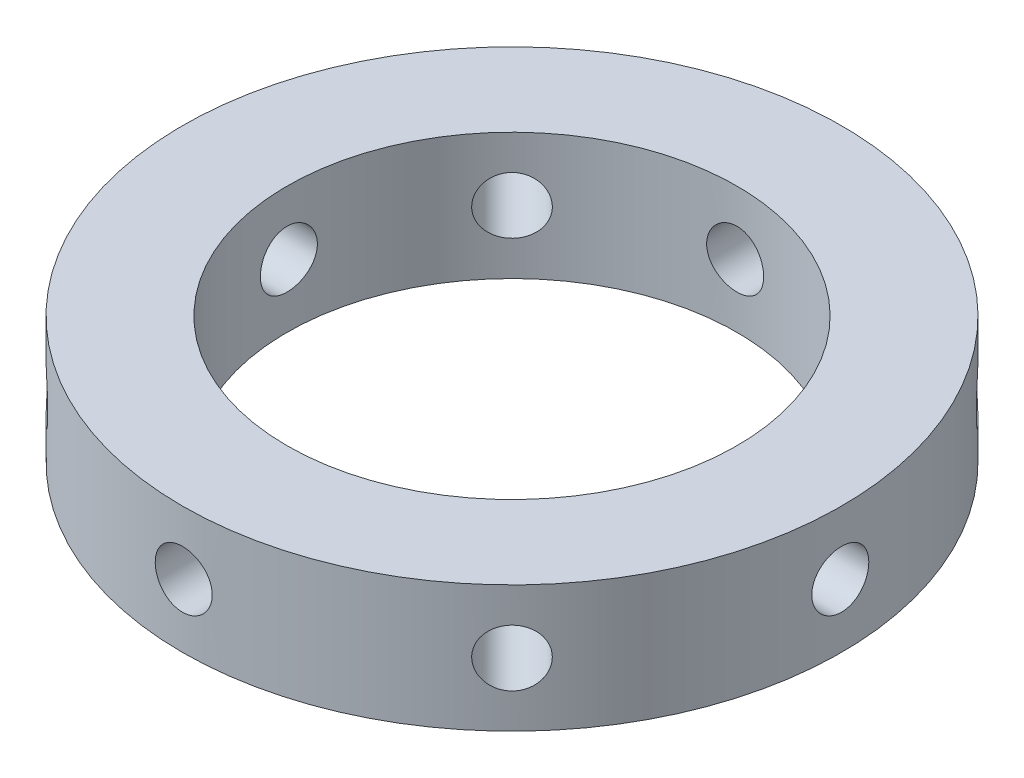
from build123d import *

# Parameters (mm, degrees)
SCHIZZO1_R                    = 26
SCHIZZO1_R_2                  = 17.75
ESTRUSIONE_ESTRUSIONE1_DEPTH  = 10
TAGLIO_ESTRUSIONE1_REACH      = 60.992
TAGLIO_ESTRUSIONE1_END_RADIUS = 17.75
SCHIZZO3_R                    = 2.25
RIPETIZIONECIRCOLARE1_COUNT   = 8


with BuildPart() as part:
    # Schizzo1 → Estrusione-Estrusione1 (new body)
    with BuildSketch(Plane(origin=(0, 0, 0), x_dir=(1, 0, 0), z_dir=(0, 1, 0))):
        with Locations(Location((0, 0, 0), (0, 0, 270))):
            Circle(SCHIZZO1_R)
        with Locations(Location((0, 0, 0), (0, 0, 270))):
            Circle(SCHIZZO1_R_2, mode=Mode.SUBTRACT)
    extrude(amount=ESTRUSIONE_ESTRUSIONE1_DEPTH)

    # Taglio-Estrusione1: up to this cylinder (the profile starts outside it)
    taglio_estrusione1_end = Plane(origin=(0, 5, 0), z_dir=(0, -1, 0)) * Cylinder(TAGLIO_ESTRUSIONE1_END_RADIUS, 158.484, mode=Mode.PRIVATE)
    # Schizzo3 → Taglio-Estrusione1 (cut, up to the surface)
    with BuildSketch(Plane(origin=(26, 0, 0), x_dir=(0, 0, -1), z_dir=(1, 0, 0)), mode=Mode.PRIVATE) as taglio_estrusione1_sk1:
        with Locations((0, 5)):
            Circle(SCHIZZO3_R)
    taglio_estrusione1_tool1 = extrude(taglio_estrusione1_sk1.sketch, amount=-TAGLIO_ESTRUSIONE1_REACH, mode=Mode.PRIVATE) - taglio_estrusione1_end
    taglio_estrusione1 = taglio_estrusione1_tool1.solids().sort_by_distance((26, 5, 0))[0]
    add(taglio_estrusione1, mode=Mode.SUBTRACT)

    # RipetizioneCircolare1: Taglio-Estrusione1 ×8 about axis
    ripetizionecircolare1_axis = Axis((0, 10, 0), (0, -1, 0))
    for i in range(1, RIPETIZIONECIRCOLARE1_COUNT):
        add(taglio_estrusione1.rotate(ripetizionecircolare1_axis, i * 360 / RIPETIZIONECIRCOLARE1_COUNT), mode=Mode.SUBTRACT)


solid = part.part
